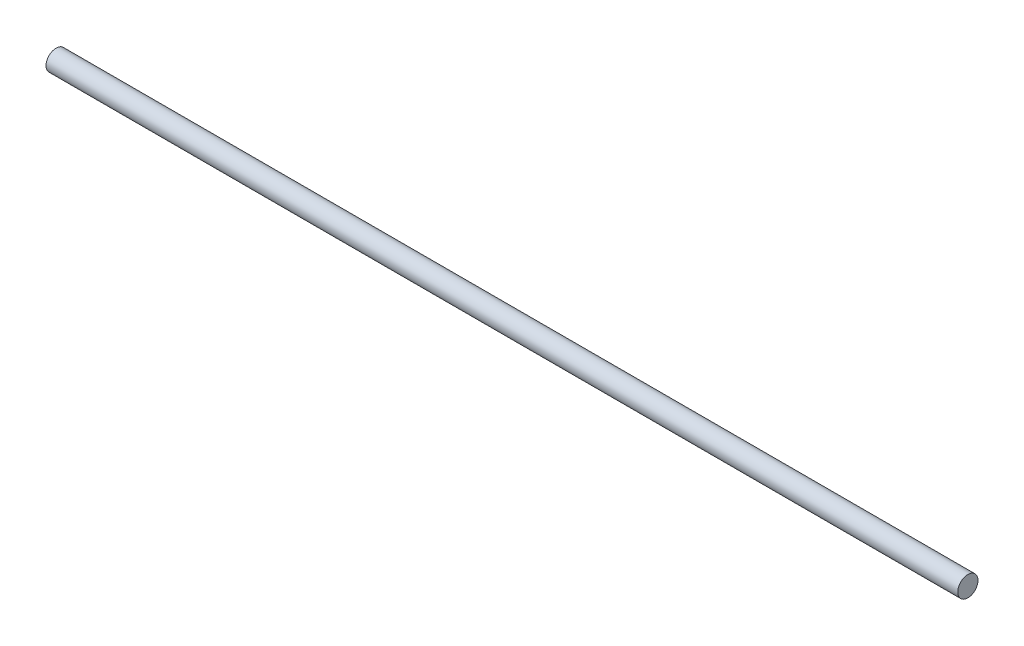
from build123d import *

# Parameters (mm, degrees)
ESQUISSE1_R      = 1
EXTRUSION1_DEPTH = 90


with BuildPart() as part:
    # Esquisse1 → Extrusion1 (new body)
    with BuildSketch(Plane(origin=(0, 0, 0), x_dir=(0, 0, -1), z_dir=(1, 0, 0))):
        with Locations(Location((0, 0, 0), (0, 0, 180))):
            Circle(ESQUISSE1_R)
    extrude(amount=EXTRUSION1_DEPTH)


solid = part.part
